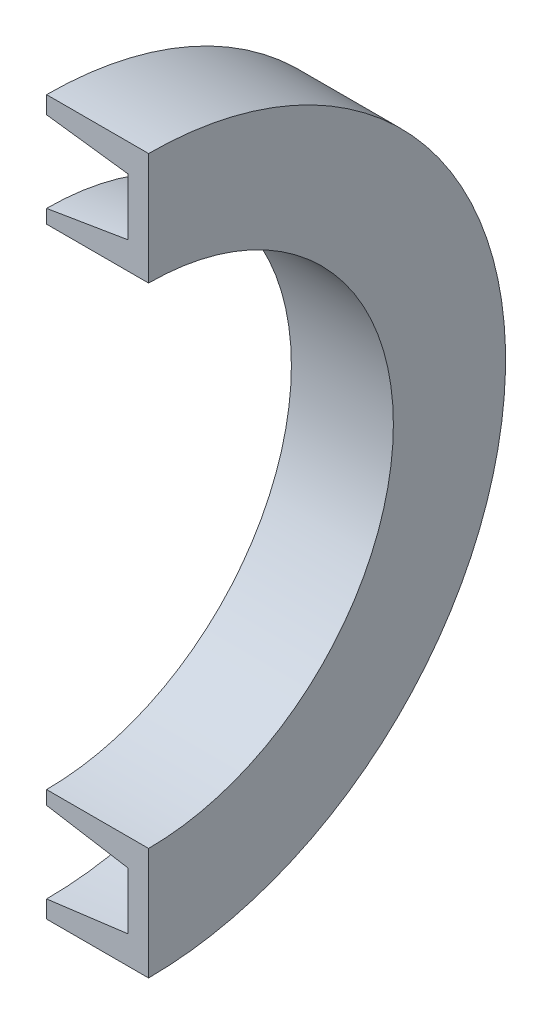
from build123d import *

# Parameters (mm, degrees)
ESQUISSE2_W             = 20
ESQUISSE2_H             = 40
ENL_V_MAT_EXTRU_1_DEPTH = 26.248762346


with BuildPart() as part:
    # Esquisse1 → Base-R_volution (revolve)
    with BuildSketch(Plane.XY):
        Polygon((-20, 12.671769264), (-16, 13.334353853), (-16, 16.128833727), (-20, 16.644168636), (-20, 17.5), (-15, 17.5), (-15, 12), (-20, 12), align=None)
    revolve(axis=Axis((0, 0, 0), (-1, 0, 0)))

    # Esquisse2 → Enl_v. mat.-Extru.1 (cut, through all)
    with BuildSketch(Plane(origin=(-15, 0, 0), x_dir=(0, 0, -1), z_dir=(1, 0, 0))):
        with Locations((-10, 0)):
            Rectangle(ESQUISSE2_W, ESQUISSE2_H)
    extrude(amount=-ENL_V_MAT_EXTRU_1_DEPTH, mode=Mode.SUBTRACT)


solid = part.part
